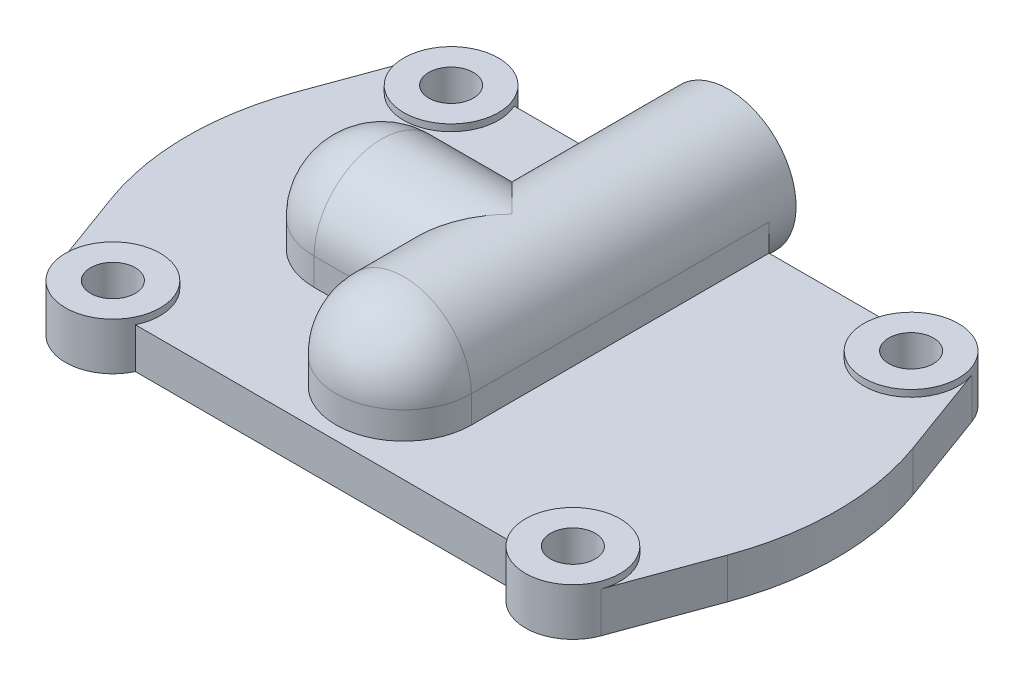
from build123d import *

# Parameters (mm, degrees)
SKETCH_1_R          = 3.3
EXTRUDE_1_DEPTH     = 6
SKETCH_15_R         = 7
SKETCH_15_R_2       = 3.3
EXTRUDE_8_DEPTH     = 1
EXTRUDE_3_DEPTH     = 4
REVOLVE_1_ANGLE     = 90
EXTRUDE_4_DEPTH     = 44
SKETCH_8_R          = 10
EXTRUDE_5_DEPTH     = 4
REVOLVE_2_ANGLE     = 90
EXTRUDE_7_REACH     = 79.114
CUT_EXTRUDE_1_REACH = 63.057
SKETCH_14_R         = 2


with BuildPart() as part:
    # Sketch 1 → Extrude 1 (new body)
    with BuildSketch(Plane(origin=(0, 0, 0), x_dir=(1, 0, 0), z_dir=(0, 1, 0))):
        with BuildLine():
            Line((-27.67544468, 28), (27.67544468, 28))
            ThreePointArc((27.67544468, 28), (34.32414408, 31.992491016), (40.574971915, 27.402029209))
            Line((40.574971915, 27.402029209), (45.571268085, 13.725881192))
            ThreePointArc((45.571268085, 13.725881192), (48, 0), (45.571268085, -13.725881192))
            Line((45.571268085, -13.725881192), (40.574971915, -27.402029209))
            ThreePointArc((40.574971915, -27.402029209), (34.32414408, -31.992491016), (27.67544468, -28))
            Line((27.67544468, -28), (-27.67544468, -28))
            ThreePointArc((-27.67544468, -28), (-34.32414408, -31.992491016), (-40.574971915, -27.402029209))
            Line((-40.574971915, -27.402029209), (-45.571268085, -13.725881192))
            ThreePointArc((-45.571268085, -13.725881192), (-48, 0), (-45.571268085, 13.725881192))
            Line((-45.571268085, 13.725881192), (-40.574971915, 27.402029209))
            ThreePointArc((-40.574971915, 27.402029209), (-34.32414408, 31.992491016), (-27.67544468, 28))
        make_face()
        with Locations(Location((-34, -25, 0), (0, 0, 270))):
            Circle(SKETCH_1_R, mode=Mode.SUBTRACT)
        with Locations(Location((-34, 25, 0), (0, 0, 90))):
            Circle(SKETCH_1_R, mode=Mode.SUBTRACT)
        with Locations(Location((34, -25, 0), (0, 0, 90))):
            Circle(SKETCH_1_R, mode=Mode.SUBTRACT)
        with Locations(Location((34, 25, 0), (0, 0, 270))):
            Circle(SKETCH_1_R, mode=Mode.SUBTRACT)
    extrude(amount=EXTRUDE_1_DEPTH)

    # Sketch 15 → Extrude 8 (add)
    # profile 1 of 4: a face of its own
    with BuildSketch(Plane(origin=(0, 6, 0), x_dir=(-1, 0, 0), z_dir=(0, 1, 0))):
        with Locations(Location((34, -25, 0), (0, 0, 205.376933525))):
            Circle(SKETCH_15_R)
        with Locations(Location((34, -25, 0), (0, 0, 270))):
            Circle(SKETCH_15_R_2, mode=Mode.SUBTRACT)
    # profile 2 of 4: a face of its own
    with BuildSketch(Plane(origin=(0, 6, 0), x_dir=(-1, 0, 0), z_dir=(0, 1, 0))):
        with Locations(Location((-34, -25, 0), (0, 0, 334.623066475))):
            Circle(SKETCH_15_R)
        with Locations(Location((-34, -25, 0), (0, 0, 90))):
            Circle(SKETCH_15_R_2, mode=Mode.SUBTRACT)
    # profile 3 of 4: a face of its own
    with BuildSketch(Plane(origin=(0, 6, 0), x_dir=(-1, 0, 0), z_dir=(0, 1, 0))):
        with Locations(Location((-34, 25, 0), (0, 0, 159.931275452))):
            Circle(SKETCH_15_R)
        with Locations(Location((-34, 25, 0), (0, 0, 270))):
            Circle(SKETCH_15_R_2, mode=Mode.SUBTRACT)
    # profile 4 of 4: a face of its own
    with BuildSketch(Plane(origin=(0, 6, 0), x_dir=(-1, 0, 0), z_dir=(0, 1, 0))):
        with Locations(Location((34, 25, 0), (0, 0, 20.068724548))):
            Circle(SKETCH_15_R)
        with Locations(Location((34, 25, 0), (0, 0, 90))):
            Circle(SKETCH_15_R_2, mode=Mode.SUBTRACT)
    extrude(amount=EXTRUDE_8_DEPTH)

    # Sketch 4 → Extrude 3 (add)
    with BuildSketch(Plane(origin=(0, 6, 0), x_dir=(-1, 0, 0), z_dir=(0, 1, 0))):
        with BuildLine():
            Line((10, -28), (10, -10))
            Line((10, -10), (19.25, -10))
            ThreePointArc((19.25, -10), (29.25, 0), (19.25, 10))
            Line((19.25, 10), (10, 10))
            Line((10, 10), (10, 16))
            ThreePointArc((10, 16), (0, 26), (-10, 16))
            Line((-10, 16), (-10, -28))
            Line((-10, -28), (10, -28))
        make_face()
    extrude(amount=EXTRUDE_3_DEPTH)

    # Sketch 5 → Revolve 1 (revolve)
    with BuildSketch(Plane(origin=(0, 10, 0), x_dir=(-1, 0, 0), z_dir=(0, 1, 0))):
        with BuildLine():
            Line((10, 16), (-10, 16))
            ThreePointArc((-10, 16), (0, 26), (10, 16))
        make_face()
    revolve(axis=Axis((-19.664804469, 10, 16), (-1, 0, 0)), revolution_arc=REVOLVE_1_ANGLE)

    # Sketch 7 → Extrude 4 (add)
    with BuildSketch(Plane(origin=(0, 0, 16), x_dir=(-1, 0, 0), z_dir=(0, 0, -1))):
        with BuildLine():
            Line((-10, 10), (10, 10))
            ThreePointArc((10, 10), (0, 20), (-10, 10))
        make_face()
    extrude(amount=EXTRUDE_4_DEPTH)

    # Sketch 8 → Extrude 5 (add)
    with BuildSketch(Plane(origin=(0, 0, -28), x_dir=(-1, 0, 0), z_dir=(0, 0, -1))):
        with Locations((0, 10)):
            Circle(SKETCH_8_R)
    extrude(amount=EXTRUDE_5_DEPTH)

    # Sketch 9 → Revolve 2 (revolve)
    with BuildSketch(Plane(origin=(0, 10, 0), x_dir=(-1, 0, 0), z_dir=(0, 1, 0))):
        with BuildLine():
            Line((19.25, -10), (19.25, 10))
            ThreePointArc((19.25, 10), (29.25, 0), (19.25, -10))
        make_face()
    revolve(axis=Axis((-19.25, 10, -17.802607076), (0, 0, -1)), revolution_arc=REVOLVE_2_ANGLE)

    # Sketch 10 → Extrude 7 (add, up to next)
    with BuildSketch(Plane(origin=(-19.25, 0, 0), x_dir=(0, 0, -1), z_dir=(1, 0, 0)), mode=Mode.PRIVATE) as extrude_7_sk1:
        with BuildLine():
            Line((-10, 10), (10, 10))
            ThreePointArc((10, 10), (0, 20), (-10, 10))
        make_face()
    extrude_7_tool1 = extrude(extrude_7_sk1.sketch, amount=EXTRUDE_7_REACH, mode=Mode.PRIVATE) - part.part
    add(extrude_7_tool1.solids().sort_by_distance((-19.25, 14.244132, 0))[0])

    # Sketch 11 → Cut-Revolve 1 (revolve, cut)
    with BuildSketch(Plane(origin=(0, 0, 0), x_dir=(0, 0, -1), z_dir=(1, 0, 0))):
        Polygon((7, 14.4585), (5.580584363, 12), (-14.845299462, 12), (-16, 10), (32, 10), (32, 14.4585), align=None)
    revolve(axis=Axis((0, 10, -33.56921167), (0, 0, 1)), mode=Mode.SUBTRACT)

    # Sketch 12 → Cut-Revolve 2 (revolve, cut)
    with BuildSketch(Plane.XY, mode=Mode.PRIVATE) as cut_revolve_2_sk:
        Polygon((-27.25, 0), (-19.25, 0), (-19.25, 16.618802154), (-27.25, 12), align=None)
    revolve(cut_revolve_2_sk.sketch.rotate(Axis((-19.25, -2.620111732, 0), (0, 1, 0)), 270), axis=Axis((-19.25, -2.620111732, 0), (0, 1, 0)), mode=Mode.SUBTRACT)

    # Sketch 13 → Cut-Revolve 3 (revolve, cut)
    with BuildSketch(Plane(origin=(0, 0, 0), x_dir=(0, 0, -1), z_dir=(1, 0, 0)), mode=Mode.PRIVATE) as cut_revolve_3_sk:
        Polygon((-16, 0), (-18, 0), (-18, 15), (-16, 16.154700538), align=None)
    revolve(cut_revolve_3_sk.sketch.rotate(Axis((0, -3.20918684, 16), (0, 1, 0)), 180), axis=Axis((0, -3.20918684, 16), (0, 1, 0)), mode=Mode.SUBTRACT)

    # Sketch 14 → Cut-Extrude 1 (cut, up to next)
    with BuildSketch(Plane.XZ, mode=Mode.PRIVATE) as cut_extrude_1_sk1:
        with Locations(Location((0, -16, 0), (0, 0, 270))):
            Circle(SKETCH_14_R)
    cut_extrude_1_tool1 = extrude(cut_extrude_1_sk1.sketch, amount=-CUT_EXTRUDE_1_REACH, mode=Mode.PRIVATE) & part.part
    add(cut_extrude_1_tool1.solids().sort_by_distance((0, 0, -16))[0], mode=Mode.SUBTRACT)


solid = part.part
